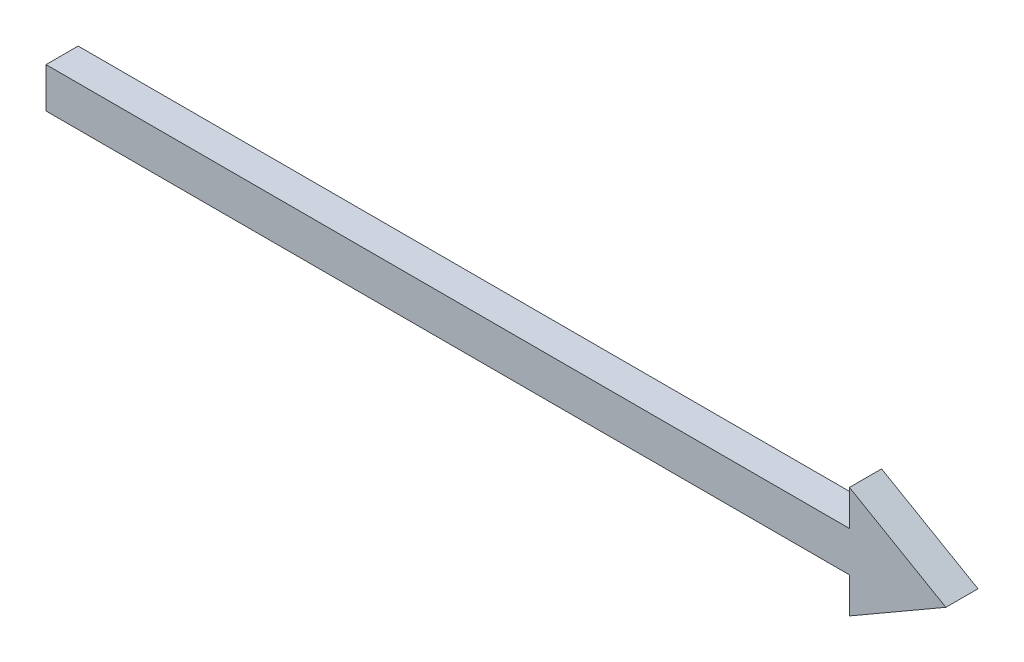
from build123d import *

# Parameters (mm, degrees)
BOSS_EXTRU_1_DEPTH = 2


with BuildPart() as part:
    # Esquisse1 → Boss.-Extru.1 (new, symmetric)
    with BuildSketch(Plane.XY):
        Polygon((180, 2.5), (180, 6.92820323), (192, 0), (180, -6.92820323), (180, -2.5), (80, -2.5), (80, 2.5), align=None)
    extrude(amount=BOSS_EXTRU_1_DEPTH, both=True)


solid = part.part
